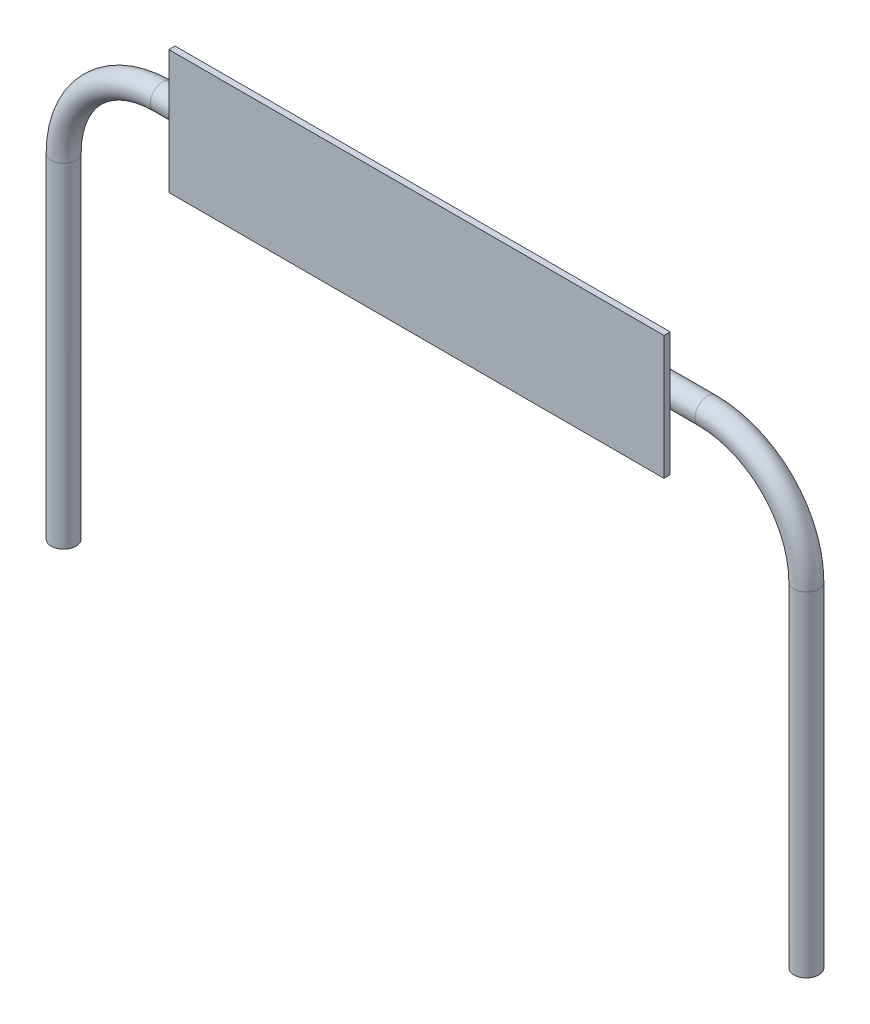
ISO-10303-21;
HEADER;
FILE_DESCRIPTION(('STEP AP214'),'2;1');
FILE_NAME('part.step','',(''),(''),'','','');
FILE_SCHEMA(('AUTOMOTIVE_DESIGN { 1 0 10303 214 1 1 1 1 }'));
ENDSEC;
DATA;
#1=APPLICATION_CONTEXT('core data for automotive mechanical design processes');
#2=APPLICATION_PROTOCOL_DEFINITION('international standard','automotive_design',2000,#1);
#3=PRODUCT_CONTEXT('',#1,'mechanical');
#4=PRODUCT('Part','Part','',(#3));
#5=PRODUCT_RELATED_PRODUCT_CATEGORY('part','',(#4));
#6=PRODUCT_DEFINITION_FORMATION('','',#4);
#7=PRODUCT_DEFINITION_CONTEXT('part definition',#1,'design');
#8=PRODUCT_DEFINITION('design','',#6,#7);
#9=PRODUCT_DEFINITION_SHAPE('','',#8);
#10=(LENGTH_UNIT() NAMED_UNIT(*) SI_UNIT(.MILLI.,.METRE.));
#11=(NAMED_UNIT(*) PLANE_ANGLE_UNIT() SI_UNIT($,.RADIAN.));
#12=(NAMED_UNIT(*) SI_UNIT($,.STERADIAN.) SOLID_ANGLE_UNIT());
#13=UNCERTAINTY_MEASURE_WITH_UNIT(LENGTH_MEASURE(1.E-05),#10,'distance_accuracy_value','');
#14=(GEOMETRIC_REPRESENTATION_CONTEXT(3) GLOBAL_UNCERTAINTY_ASSIGNED_CONTEXT((#13)) GLOBAL_UNIT_ASSIGNED_CONTEXT((#10,
#11,#12)) REPRESENTATION_CONTEXT('',''));
#15=CARTESIAN_POINT('',(0.,0.,0.));
#16=DIRECTION('',(0.,0.,1.));
#17=DIRECTION('',(1.,0.,0.));
#18=AXIS2_PLACEMENT_3D('',#15,#16,#17);
#19=CARTESIAN_POINT('',(-2895.6,-426.720000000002,182.880000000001));
#20=DIRECTION('',(1.,0.,0.));
#21=DIRECTION('',(0.,0.,1.));
#22=AXIS2_PLACEMENT_3D('',#19,#20,#21);
#23=CYLINDRICAL_SURFACE('',#22,121.92);
#24=CARTESIAN_POINT('',(-2438.4,-426.720000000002,182.880000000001));
#25=DIRECTION('',(1.,0.,0.));
#26=DIRECTION('',(0.,0.,-1.));
#27=AXIS2_PLACEMENT_3D('',#24,#25,#26);
#28=CIRCLE('',#27,121.92);
#29=CARTESIAN_POINT('',(-2438.4,-304.800000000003,182.880000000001));
#30=VERTEX_POINT('',#29);
#31=CARTESIAN_POINT('',(-2438.4,-426.720000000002,304.800000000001));
#32=VERTEX_POINT('',#31);
#33=EDGE_CURVE('E195',#30,#32,#28,.T.);
#34=ORIENTED_EDGE('',*,*,#33,.F.);
#35=DIRECTION('',(1.,0.,0.));
#36=VECTOR('',#35,1.);
#37=CARTESIAN_POINT('',(-2895.6,-304.800000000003,182.880000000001));
#38=LINE('',#37,#36);
#39=CARTESIAN_POINT('',(-2895.6,-304.800000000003,182.880000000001));
#40=VERTEX_POINT('',#39);
#41=EDGE_CURVE('E194',#40,#30,#38,.T.);
#42=ORIENTED_EDGE('',*,*,#41,.F.);
#43=CARTESIAN_POINT('',(-2895.6,-426.720000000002,182.880000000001));
#44=DIRECTION('',(1.,0.,0.));
#45=DIRECTION('',(0.,0.,-1.));
#46=AXIS2_PLACEMENT_3D('',#43,#44,#45);
#47=CIRCLE('',#46,121.92);
#48=CARTESIAN_POINT('',(-2895.6,-426.720000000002,304.800000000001));
#49=VERTEX_POINT('',#48);
#50=EDGE_CURVE('E237',#40,#49,#47,.T.);
#51=ORIENTED_EDGE('',*,*,#50,.T.);
#52=DIRECTION('',(1.,0.,0.));
#53=VECTOR('',#52,1.);
#54=CARTESIAN_POINT('',(-2895.6,-426.720000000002,304.800000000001));
#55=LINE('',#54,#53);
#56=EDGE_CURVE('E12',#49,#32,#55,.T.);
#57=ORIENTED_EDGE('',*,*,#56,.T.);
#58=EDGE_LOOP('',(#34,#42,#51,#57));
#59=FACE_BOUND('',#58,.T.);
#60=ADVANCED_FACE('F51',(#59),#23,.T.);
#61=CARTESIAN_POINT('',(-2895.6,-426.720000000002,304.800000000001));
#62=DIRECTION('',(0.,0.,-1.));
#63=DIRECTION('',(1.,0.,0.));
#64=AXIS2_PLACEMENT_3D('',#61,#62,#63);
#65=PLANE('',#64);
#66=DIRECTION('',(0.,-1.,0.));
#67=VECTOR('',#66,1.);
#68=CARTESIAN_POINT('',(-2438.4,-426.720000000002,304.800000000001));
#69=LINE('',#68,#67);
#70=CARTESIAN_POINT('',(-2438.4,-609.600000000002,304.800000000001));
#71=VERTEX_POINT('',#70);
#72=EDGE_CURVE('E197',#32,#71,#69,.T.);
#73=ORIENTED_EDGE('',*,*,#72,.F.);
#74=ORIENTED_EDGE('',*,*,#56,.F.);
#75=DIRECTION('',(0.,-1.,0.));
#76=VECTOR('',#75,1.);
#77=CARTESIAN_POINT('',(-2895.6,-426.720000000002,304.800000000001));
#78=LINE('',#77,#76);
#79=CARTESIAN_POINT('',(-2895.6,-609.600000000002,304.800000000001));
#80=VERTEX_POINT('',#79);
#81=EDGE_CURVE('E129',#49,#80,#78,.T.);
#82=ORIENTED_EDGE('',*,*,#81,.T.);
#83=DIRECTION('',(1.,0.,0.));
#84=VECTOR('',#83,1.);
#85=CARTESIAN_POINT('',(-2895.6,-609.600000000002,304.800000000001));
#86=LINE('',#85,#84);
#87=EDGE_CURVE('E59',#80,#71,#86,.T.);
#88=ORIENTED_EDGE('',*,*,#87,.T.);
#89=EDGE_LOOP('',(#73,#74,#82,#88));
#90=FACE_BOUND('',#89,.T.);
#91=ADVANCED_FACE('F273',(#90),#65,.F.);
#92=CARTESIAN_POINT('',(-2895.6,-609.600000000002,213.360000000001));
#93=DIRECTION('',(0.,1.,0.));
#94=DIRECTION('',(0.,0.,1.));
#95=AXIS2_PLACEMENT_3D('',#92,#93,#94);
#96=PLANE('',#95);
#97=DIRECTION('',(0.,0.,-1.));
#98=VECTOR('',#97,1.);
#99=CARTESIAN_POINT('',(-2438.4,-609.600000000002,213.360000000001));
#100=LINE('',#99,#98);
#101=CARTESIAN_POINT('',(-2438.4,-609.600000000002,213.360000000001));
#102=VERTEX_POINT('',#101);
#103=EDGE_CURVE('E200',#71,#102,#100,.T.);
#104=ORIENTED_EDGE('',*,*,#103,.F.);
#105=ORIENTED_EDGE('',*,*,#87,.F.);
#106=DIRECTION('',(0.,0.,-1.));
#107=VECTOR('',#106,1.);
#108=CARTESIAN_POINT('',(-2895.6,-609.600000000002,213.360000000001));
#109=LINE('',#108,#107);
#110=CARTESIAN_POINT('',(-2895.6,-609.600000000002,213.360000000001));
#111=VERTEX_POINT('',#110);
#112=EDGE_CURVE('E282',#80,#111,#109,.T.);
#113=ORIENTED_EDGE('',*,*,#112,.T.);
#114=DIRECTION('',(1.,0.,0.));
#115=VECTOR('',#114,1.);
#116=CARTESIAN_POINT('',(-2895.6,-609.600000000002,213.360000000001));
#117=LINE('',#116,#115);
#118=EDGE_CURVE('E268',#111,#102,#117,.T.);
#119=ORIENTED_EDGE('',*,*,#118,.T.);
#120=EDGE_LOOP('',(#104,#105,#113,#119));
#121=FACE_BOUND('',#120,.T.);
#122=ADVANCED_FACE('F340',(#121),#96,.F.);
#123=CARTESIAN_POINT('',(-2895.6,-426.720000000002,213.360000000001));
#124=DIRECTION('',(0.,0.,1.));
#125=DIRECTION('',(-1.,0.,0.));
#126=AXIS2_PLACEMENT_3D('',#123,#124,#125);
#127=PLANE('',#126);
#128=DIRECTION('',(0.,1.,0.));
#129=VECTOR('',#128,1.);
#130=CARTESIAN_POINT('',(-2438.4,-426.720000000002,213.360000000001));
#131=LINE('',#130,#129);
#132=CARTESIAN_POINT('',(-2438.4,-426.720000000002,213.360000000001));
#133=VERTEX_POINT('',#132);
#134=EDGE_CURVE('E203',#102,#133,#131,.T.);
#135=ORIENTED_EDGE('',*,*,#134,.F.);
#136=ORIENTED_EDGE('',*,*,#118,.F.);
#137=DIRECTION('',(0.,1.,0.));
#138=VECTOR('',#137,1.);
#139=CARTESIAN_POINT('',(-2895.6,-426.720000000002,213.360000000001));
#140=LINE('',#139,#138);
#141=CARTESIAN_POINT('',(-2895.6,-426.720000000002,213.360000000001));
#142=VERTEX_POINT('',#141);
#143=EDGE_CURVE('E286',#111,#142,#140,.T.);
#144=ORIENTED_EDGE('',*,*,#143,.T.);
#145=DIRECTION('',(1.,0.,0.));
#146=VECTOR('',#145,1.);
#147=CARTESIAN_POINT('',(-2895.6,-426.720000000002,213.360000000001));
#148=LINE('',#147,#146);
#149=EDGE_CURVE('E265',#142,#133,#148,.T.);
#150=ORIENTED_EDGE('',*,*,#149,.T.);
#151=EDGE_LOOP('',(#135,#136,#144,#150));
#152=FACE_BOUND('',#151,.T.);
#153=ADVANCED_FACE('F339',(#152),#127,.F.);
#154=CARTESIAN_POINT('',(-2895.6,-426.720000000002,182.880000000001));
#155=DIRECTION('',(1.,0.,0.));
#156=DIRECTION('',(0.,0.,1.));
#157=AXIS2_PLACEMENT_3D('',#154,#155,#156);
#158=CYLINDRICAL_SURFACE('',#157,30.48);
#159=CARTESIAN_POINT('',(-2438.4,-426.720000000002,182.880000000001));
#160=DIRECTION('',(-1.,0.,0.));
#161=DIRECTION('',(0.,0.,-1.));
#162=AXIS2_PLACEMENT_3D('',#159,#160,#161);
#163=CIRCLE('',#162,30.48);
#164=CARTESIAN_POINT('',(-2438.4,-396.240000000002,182.880000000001));
#165=VERTEX_POINT('',#164);
#166=EDGE_CURVE('E206',#133,#165,#163,.T.);
#167=ORIENTED_EDGE('',*,*,#166,.F.);
#168=ORIENTED_EDGE('',*,*,#149,.F.);
#169=CARTESIAN_POINT('',(-2895.6,-426.720000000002,182.880000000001));
#170=DIRECTION('',(-1.,0.,0.));
#171=DIRECTION('',(0.,0.,-1.));
#172=AXIS2_PLACEMENT_3D('',#169,#170,#171);
#173=CIRCLE('',#172,30.48);
#174=CARTESIAN_POINT('',(-2895.6,-396.240000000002,182.880000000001));
#175=VERTEX_POINT('',#174);
#176=EDGE_CURVE('E289',#142,#175,#173,.T.);
#177=ORIENTED_EDGE('',*,*,#176,.T.);
#178=DIRECTION('',(1.,0.,0.));
#179=VECTOR('',#178,1.);
#180=CARTESIAN_POINT('',(-2895.6,-396.240000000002,182.880000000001));
#181=LINE('',#180,#179);
#182=EDGE_CURVE('E262',#175,#165,#181,.T.);
#183=ORIENTED_EDGE('',*,*,#182,.T.);
#184=EDGE_LOOP('',(#167,#168,#177,#183));
#185=FACE_BOUND('',#184,.T.);
#186=ADVANCED_FACE('F336',(#185),#158,.F.);
#187=CARTESIAN_POINT('',(-2895.6,-396.240000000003,0.));
#188=DIRECTION('',(0.,1.,0.));
#189=DIRECTION('',(0.,0.,1.));
#190=AXIS2_PLACEMENT_3D('',#187,#188,#189);
#191=PLANE('',#190);
#192=DIRECTION('',(0.,0.,-1.));
#193=VECTOR('',#192,1.);
#194=CARTESIAN_POINT('',(-2438.4,-396.240000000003,0.));
#195=LINE('',#194,#193);
#196=CARTESIAN_POINT('',(-2438.4,-396.240000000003,0.));
#197=VERTEX_POINT('',#196);
#198=EDGE_CURVE('E209',#165,#197,#195,.T.);
#199=ORIENTED_EDGE('',*,*,#198,.F.);
#200=ORIENTED_EDGE('',*,*,#182,.F.);
#201=DIRECTION('',(0.,0.,-1.));
#202=VECTOR('',#201,1.);
#203=CARTESIAN_POINT('',(-2895.6,-396.240000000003,0.));
#204=LINE('',#203,#202);
#205=CARTESIAN_POINT('',(-2895.6,-396.240000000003,0.));
#206=VERTEX_POINT('',#205);
#207=EDGE_CURVE('E292',#175,#206,#204,.T.);
#208=ORIENTED_EDGE('',*,*,#207,.T.);
#209=DIRECTION('',(1.,0.,0.));
#210=VECTOR('',#209,1.);
#211=CARTESIAN_POINT('',(-2895.6,-396.240000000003,0.));
#212=LINE('',#211,#210);
#213=EDGE_CURVE('E259',#206,#197,#212,.T.);
#214=ORIENTED_EDGE('',*,*,#213,.T.);
#215=EDGE_LOOP('',(#199,#200,#208,#214));
#216=FACE_BOUND('',#215,.T.);
#217=ADVANCED_FACE('F334',(#216),#191,.F.);
#218=CARTESIAN_POINT('',(-2895.6,-1.77635683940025E-12,0.));
#219=DIRECTION('',(1.,0.,0.));
#220=DIRECTION('',(0.,0.,1.));
#221=AXIS2_PLACEMENT_3D('',#218,#219,#220);
#222=CYLINDRICAL_SURFACE('',#221,396.240000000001);
#223=CARTESIAN_POINT('',(-2438.4,-1.77635683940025E-12,0.));
#224=DIRECTION('',(1.,0.,0.));
#225=DIRECTION('',(0.,0.,-1.));
#226=AXIS2_PLACEMENT_3D('',#223,#224,#225);
#227=CIRCLE('',#226,396.240000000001);
#228=CARTESIAN_POINT('',(-2438.4,396.239999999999,-1.21313511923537E-13));
#229=VERTEX_POINT('',#228);
#230=EDGE_CURVE('E212',#197,#229,#227,.T.);
#231=ORIENTED_EDGE('',*,*,#230,.F.);
#232=ORIENTED_EDGE('',*,*,#213,.F.);
#233=CARTESIAN_POINT('',(-2895.6,-1.77635683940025E-12,0.));
#234=DIRECTION('',(1.,0.,0.));
#235=DIRECTION('',(0.,0.,-1.));
#236=AXIS2_PLACEMENT_3D('',#233,#234,#235);
#237=CIRCLE('',#236,396.240000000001);
#238=CARTESIAN_POINT('',(-2895.6,396.239999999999,-1.21313511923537E-13));
#239=VERTEX_POINT('',#238);
#240=EDGE_CURVE('E295',#206,#239,#237,.T.);
#241=ORIENTED_EDGE('',*,*,#240,.T.);
#242=DIRECTION('',(1.,0.,0.));
#243=VECTOR('',#242,1.);
#244=CARTESIAN_POINT('',(-2895.6,396.239999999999,-1.21313511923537E-13));
#245=LINE('',#244,#243);
#246=EDGE_CURVE('E256',#239,#229,#245,.T.);
#247=ORIENTED_EDGE('',*,*,#246,.T.);
#248=EDGE_LOOP('',(#231,#232,#241,#247));
#249=FACE_BOUND('',#248,.T.);
#250=ADVANCED_FACE('F330',(#249),#222,.T.);
#251=CARTESIAN_POINT('',(-2895.6,396.239999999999,-1.21313511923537E-13));
#252=DIRECTION('',(0.,-1.,0.));
#253=DIRECTION('',(0.,0.,-1.));
#254=AXIS2_PLACEMENT_3D('',#251,#252,#253);
#255=PLANE('',#254);
#256=DIRECTION('',(0.,0.,1.));
#257=VECTOR('',#256,1.);
#258=CARTESIAN_POINT('',(-2438.4,396.239999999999,-1.21313511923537E-13));
#259=LINE('',#258,#257);
#260=CARTESIAN_POINT('',(-2438.4,396.240000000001,182.880000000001));
#261=VERTEX_POINT('',#260);
#262=EDGE_CURVE('E215',#229,#261,#259,.T.);
#263=ORIENTED_EDGE('',*,*,#262,.F.);
#264=ORIENTED_EDGE('',*,*,#246,.F.);
#265=DIRECTION('',(0.,0.,1.));
#266=VECTOR('',#265,1.);
#267=CARTESIAN_POINT('',(-2895.6,396.239999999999,-1.21313511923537E-13));
#268=LINE('',#267,#266);
#269=CARTESIAN_POINT('',(-2895.6,396.240000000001,182.880000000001));
#270=VERTEX_POINT('',#269);
#271=EDGE_CURVE('E298',#239,#270,#268,.T.);
#272=ORIENTED_EDGE('',*,*,#271,.T.);
#273=DIRECTION('',(1.,0.,0.));
#274=VECTOR('',#273,1.);
#275=CARTESIAN_POINT('',(-2895.6,396.240000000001,182.880000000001));
#276=LINE('',#275,#274);
#277=EDGE_CURVE('E253',#270,#261,#276,.T.);
#278=ORIENTED_EDGE('',*,*,#277,.T.);
#279=EDGE_LOOP('',(#263,#264,#272,#278));
#280=FACE_BOUND('',#279,.T.);
#281=ADVANCED_FACE('F327',(#280),#255,.F.);
#282=CARTESIAN_POINT('',(-2895.6,426.720000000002,182.880000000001));
#283=DIRECTION('',(1.,0.,0.));
#284=DIRECTION('',(0.,0.,1.));
#285=AXIS2_PLACEMENT_3D('',#282,#283,#284);
#286=CYLINDRICAL_SURFACE('',#285,30.4800000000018);
#287=CARTESIAN_POINT('',(-2438.4,426.720000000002,182.880000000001));
#288=DIRECTION('',(-1.,0.,0.));
#289=DIRECTION('',(0.,0.,1.));
#290=AXIS2_PLACEMENT_3D('',#287,#288,#289);
#291=CIRCLE('',#290,30.4800000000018);
#292=CARTESIAN_POINT('',(-2438.4,426.720000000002,213.360000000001));
#293=VERTEX_POINT('',#292);
#294=EDGE_CURVE('E218',#261,#293,#291,.T.);
#295=ORIENTED_EDGE('',*,*,#294,.F.);
#296=ORIENTED_EDGE('',*,*,#277,.F.);
#297=CARTESIAN_POINT('',(-2895.6,426.720000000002,182.880000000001));
#298=DIRECTION('',(-1.,0.,0.));
#299=DIRECTION('',(0.,0.,1.));
#300=AXIS2_PLACEMENT_3D('',#297,#298,#299);
#301=CIRCLE('',#300,30.4800000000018);
#302=CARTESIAN_POINT('',(-2895.6,426.720000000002,213.360000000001));
#303=VERTEX_POINT('',#302);
#304=EDGE_CURVE('E301',#270,#303,#301,.T.);
#305=ORIENTED_EDGE('',*,*,#304,.T.);
#306=DIRECTION('',(1.,0.,0.));
#307=VECTOR('',#306,1.);
#308=CARTESIAN_POINT('',(-2895.6,426.720000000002,213.360000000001));
#309=LINE('',#308,#307);
#310=EDGE_CURVE('E250',#303,#293,#309,.T.);
#311=ORIENTED_EDGE('',*,*,#310,.T.);
#312=EDGE_LOOP('',(#295,#296,#305,#311));
#313=FACE_BOUND('',#312,.T.);
#314=ADVANCED_FACE('F325',(#313),#286,.F.);
#315=CARTESIAN_POINT('',(-2895.6,426.720000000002,213.360000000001));
#316=DIRECTION('',(0.,0.,1.));
#317=DIRECTION('',(-1.,0.,0.));
#318=AXIS2_PLACEMENT_3D('',#315,#316,#317);
#319=PLANE('',#318);
#320=DIRECTION('',(0.,1.,0.));
#321=VECTOR('',#320,1.);
#322=CARTESIAN_POINT('',(-2438.4,426.720000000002,213.360000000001));
#323=LINE('',#322,#321);
#324=CARTESIAN_POINT('',(-2438.4,609.600000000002,213.360000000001));
#325=VERTEX_POINT('',#324);
#326=EDGE_CURVE('E221',#293,#325,#323,.T.);
#327=ORIENTED_EDGE('',*,*,#326,.F.);
#328=ORIENTED_EDGE('',*,*,#310,.F.);
#329=DIRECTION('',(0.,1.,0.));
#330=VECTOR('',#329,1.);
#331=CARTESIAN_POINT('',(-2895.6,426.720000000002,213.360000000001));
#332=LINE('',#331,#330);
#333=CARTESIAN_POINT('',(-2895.6,609.600000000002,213.360000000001));
#334=VERTEX_POINT('',#333);
#335=EDGE_CURVE('E304',#303,#334,#332,.T.);
#336=ORIENTED_EDGE('',*,*,#335,.T.);
#337=DIRECTION('',(1.,0.,0.));
#338=VECTOR('',#337,1.);
#339=CARTESIAN_POINT('',(-2895.6,609.600000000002,213.360000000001));
#340=LINE('',#339,#338);
#341=EDGE_CURVE('E247',#334,#325,#340,.T.);
#342=ORIENTED_EDGE('',*,*,#341,.T.);
#343=EDGE_LOOP('',(#327,#328,#336,#342));
#344=FACE_BOUND('',#343,.T.);
#345=ADVANCED_FACE('F321',(#344),#319,.F.);
#346=CARTESIAN_POINT('',(-2895.6,609.600000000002,213.360000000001));
#347=DIRECTION('',(0.,-1.,0.));
#348=DIRECTION('',(0.,0.,-1.));
#349=AXIS2_PLACEMENT_3D('',#346,#347,#348);
#350=PLANE('',#349);
#351=DIRECTION('',(0.,0.,1.));
#352=VECTOR('',#351,1.);
#353=CARTESIAN_POINT('',(-2438.4,609.600000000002,213.360000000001));
#354=LINE('',#353,#352);
#355=CARTESIAN_POINT('',(-2438.4,609.600000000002,304.800000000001));
#356=VERTEX_POINT('',#355);
#357=EDGE_CURVE('E224',#325,#356,#354,.T.);
#358=ORIENTED_EDGE('',*,*,#357,.F.);
#359=ORIENTED_EDGE('',*,*,#341,.F.);
#360=DIRECTION('',(0.,0.,1.));
#361=VECTOR('',#360,1.);
#362=CARTESIAN_POINT('',(-2895.6,609.600000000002,213.360000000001));
#363=LINE('',#362,#361);
#364=CARTESIAN_POINT('',(-2895.6,609.600000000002,304.800000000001));
#365=VERTEX_POINT('',#364);
#366=EDGE_CURVE('E307',#334,#365,#363,.T.);
#367=ORIENTED_EDGE('',*,*,#366,.T.);
#368=DIRECTION('',(1.,0.,0.));
#369=VECTOR('',#368,1.);
#370=CARTESIAN_POINT('',(-2895.6,609.600000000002,304.800000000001));
#371=LINE('',#370,#369);
#372=EDGE_CURVE('E244',#365,#356,#371,.T.);
#373=ORIENTED_EDGE('',*,*,#372,.T.);
#374=EDGE_LOOP('',(#358,#359,#367,#373));
#375=FACE_BOUND('',#374,.T.);
#376=ADVANCED_FACE('F318',(#375),#350,.F.);
#377=CARTESIAN_POINT('',(-2895.6,426.720000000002,304.800000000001));
#378=DIRECTION('',(0.,0.,-1.));
#379=DIRECTION('',(1.,0.,0.));
#380=AXIS2_PLACEMENT_3D('',#377,#378,#379);
#381=PLANE('',#380);
#382=DIRECTION('',(0.,-1.,0.));
#383=VECTOR('',#382,1.);
#384=CARTESIAN_POINT('',(-2438.4,426.720000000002,304.800000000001));
#385=LINE('',#384,#383);
#386=CARTESIAN_POINT('',(-2438.4,426.720000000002,304.800000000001));
#387=VERTEX_POINT('',#386);
#388=EDGE_CURVE('E227',#356,#387,#385,.T.);
#389=ORIENTED_EDGE('',*,*,#388,.F.);
#390=ORIENTED_EDGE('',*,*,#372,.F.);
#391=DIRECTION('',(0.,-1.,0.));
#392=VECTOR('',#391,1.);
#393=CARTESIAN_POINT('',(-2895.6,426.720000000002,304.800000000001));
#394=LINE('',#393,#392);
#395=CARTESIAN_POINT('',(-2895.6,426.720000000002,304.800000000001));
#396=VERTEX_POINT('',#395);
#397=EDGE_CURVE('E189',#365,#396,#394,.T.);
#398=ORIENTED_EDGE('',*,*,#397,.T.);
#399=DIRECTION('',(1.,0.,0.));
#400=VECTOR('',#399,1.);
#401=CARTESIAN_POINT('',(-2895.6,426.720000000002,304.800000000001));
#402=LINE('',#401,#400);
#403=EDGE_CURVE('E241',#396,#387,#402,.T.);
#404=ORIENTED_EDGE('',*,*,#403,.T.);
#405=EDGE_LOOP('',(#389,#390,#398,#404));
#406=FACE_BOUND('',#405,.T.);
#407=ADVANCED_FACE('F312',(#406),#381,.F.);
#408=CARTESIAN_POINT('',(-2895.6,426.720000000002,182.880000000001));
#409=DIRECTION('',(1.,0.,0.));
#410=DIRECTION('',(0.,0.,1.));
#411=AXIS2_PLACEMENT_3D('',#408,#409,#410);
#412=CYLINDRICAL_SURFACE('',#411,121.92);
#413=CARTESIAN_POINT('',(-2438.4,426.720000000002,182.880000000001));
#414=DIRECTION('',(1.,0.,0.));
#415=DIRECTION('',(0.,0.,1.));
#416=AXIS2_PLACEMENT_3D('',#413,#414,#415);
#417=CIRCLE('',#416,121.92);
#418=CARTESIAN_POINT('',(-2438.4,304.800000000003,182.880000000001));
#419=VERTEX_POINT('',#418);
#420=EDGE_CURVE('E230',#387,#419,#417,.T.);
#421=ORIENTED_EDGE('',*,*,#420,.F.);
#422=ORIENTED_EDGE('',*,*,#403,.F.);
#423=CARTESIAN_POINT('',(-2895.6,426.720000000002,182.880000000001));
#424=DIRECTION('',(1.,0.,0.));
#425=DIRECTION('',(0.,0.,1.));
#426=AXIS2_PLACEMENT_3D('',#423,#424,#425);
#427=CIRCLE('',#426,121.92);
#428=CARTESIAN_POINT('',(-2895.6,304.800000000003,182.880000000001));
#429=VERTEX_POINT('',#428);
#430=EDGE_CURVE('E187',#396,#429,#427,.T.);
#431=ORIENTED_EDGE('',*,*,#430,.T.);
#432=DIRECTION('',(1.,0.,0.));
#433=VECTOR('',#432,1.);
#434=CARTESIAN_POINT('',(-2895.6,304.800000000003,182.880000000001));
#435=LINE('',#434,#433);
#436=EDGE_CURVE('E181',#429,#419,#435,.T.);
#437=ORIENTED_EDGE('',*,*,#436,.T.);
#438=EDGE_LOOP('',(#421,#422,#431,#437));
#439=FACE_BOUND('',#438,.T.);
#440=ADVANCED_FACE('F316',(#439),#412,.T.);
#441=CARTESIAN_POINT('',(-2895.6,304.799999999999,0.));
#442=DIRECTION('',(0.,1.,0.));
#443=DIRECTION('',(0.,0.,1.));
#444=AXIS2_PLACEMENT_3D('',#441,#442,#443);
#445=PLANE('',#444);
#446=DIRECTION('',(0.,0.,-1.));
#447=VECTOR('',#446,1.);
#448=CARTESIAN_POINT('',(-2438.4,304.799999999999,0.));
#449=LINE('',#448,#447);
#450=CARTESIAN_POINT('',(-2438.4,304.799999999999,0.));
#451=VERTEX_POINT('',#450);
#452=EDGE_CURVE('E233',#419,#451,#449,.T.);
#453=ORIENTED_EDGE('',*,*,#452,.F.);
#454=ORIENTED_EDGE('',*,*,#436,.F.);
#455=DIRECTION('',(0.,0.,-1.));
#456=VECTOR('',#455,1.);
#457=CARTESIAN_POINT('',(-2895.6,304.799999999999,0.));
#458=LINE('',#457,#456);
#459=CARTESIAN_POINT('',(-2895.6,304.799999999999,0.));
#460=VERTEX_POINT('',#459);
#461=EDGE_CURVE('E171',#429,#460,#458,.T.);
#462=ORIENTED_EDGE('',*,*,#461,.T.);
#463=DIRECTION('',(1.,0.,0.));
#464=VECTOR('',#463,1.);
#465=CARTESIAN_POINT('',(-2895.6,304.799999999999,0.));
#466=LINE('',#465,#464);
#467=EDGE_CURVE('E176',#460,#451,#466,.T.);
#468=ORIENTED_EDGE('',*,*,#467,.T.);
#469=EDGE_LOOP('',(#453,#454,#462,#468));
#470=FACE_BOUND('',#469,.T.);
#471=ADVANCED_FACE('F184',(#470),#445,.F.);
#472=CARTESIAN_POINT('',(-2895.6,-1.77635683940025E-12,0.));
#473=DIRECTION('',(1.,0.,0.));
#474=DIRECTION('',(0.,0.,1.));
#475=AXIS2_PLACEMENT_3D('',#472,#473,#474);
#476=CYLINDRICAL_SURFACE('',#475,304.800000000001);
#477=CARTESIAN_POINT('',(-2438.4,-1.77635683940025E-12,0.));
#478=DIRECTION('',(-1.,0.,0.));
#479=DIRECTION('',(0.,0.,-1.));
#480=AXIS2_PLACEMENT_3D('',#477,#478,#479);
#481=CIRCLE('',#480,304.800000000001);
#482=CARTESIAN_POINT('',(-2438.4,-304.800000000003,0.));
#483=VERTEX_POINT('',#482);
#484=EDGE_CURVE('E178',#451,#483,#481,.T.);
#485=ORIENTED_EDGE('',*,*,#484,.F.);
#486=ORIENTED_EDGE('',*,*,#467,.F.);
#487=CARTESIAN_POINT('',(-2895.6,-1.77635683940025E-12,0.));
#488=DIRECTION('',(-1.,0.,0.));
#489=DIRECTION('',(0.,0.,-1.));
#490=AXIS2_PLACEMENT_3D('',#487,#488,#489);
#491=CIRCLE('',#490,304.800000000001);
#492=CARTESIAN_POINT('',(-2895.6,-304.800000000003,0.));
#493=VERTEX_POINT('',#492);
#494=EDGE_CURVE('E167',#460,#493,#491,.T.);
#495=ORIENTED_EDGE('',*,*,#494,.T.);
#496=DIRECTION('',(1.,0.,0.));
#497=VECTOR('',#496,1.);
#498=CARTESIAN_POINT('',(-2895.6,-304.800000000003,0.));
#499=LINE('',#498,#497);
#500=EDGE_CURVE('E182',#493,#483,#499,.T.);
#501=ORIENTED_EDGE('',*,*,#500,.T.);
#502=EDGE_LOOP('',(#485,#486,#495,#501));
#503=FACE_BOUND('',#502,.T.);
#504=ADVANCED_FACE('F177',(#503),#476,.F.);
#505=CARTESIAN_POINT('',(-2895.6,-304.800000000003,0.));
#506=DIRECTION('',(0.,-1.,0.));
#507=DIRECTION('',(0.,0.,-1.));
#508=AXIS2_PLACEMENT_3D('',#505,#506,#507);
#509=PLANE('',#508);
#510=DIRECTION('',(0.,0.,1.));
#511=VECTOR('',#510,1.);
#512=CARTESIAN_POINT('',(-2438.4,-304.800000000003,0.));
#513=LINE('',#512,#511);
#514=EDGE_CURVE('E117',#483,#30,#513,.T.);
#515=ORIENTED_EDGE('',*,*,#514,.F.);
#516=ORIENTED_EDGE('',*,*,#500,.F.);
#517=DIRECTION('',(0.,0.,1.));
#518=VECTOR('',#517,1.);
#519=CARTESIAN_POINT('',(-2895.6,-304.800000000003,0.));
#520=LINE('',#519,#518);
#521=EDGE_CURVE('E67',#493,#40,#520,.T.);
#522=ORIENTED_EDGE('',*,*,#521,.T.);
#523=ORIENTED_EDGE('',*,*,#41,.T.);
#524=EDGE_LOOP('',(#515,#516,#522,#523));
#525=FACE_BOUND('',#524,.T.);
#526=ADVANCED_FACE('F470',(#525),#509,.F.);
#527=CARTESIAN_POINT('',(-2895.6,-426.720000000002,182.880000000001));
#528=DIRECTION('',(-1.,0.,0.));
#529=DIRECTION('',(0.,0.,-1.));
#530=AXIS2_PLACEMENT_3D('',#527,#528,#529);
#531=PLANE('',#530);
#532=ORIENTED_EDGE('',*,*,#50,.F.);
#533=ORIENTED_EDGE('',*,*,#521,.F.);
#534=ORIENTED_EDGE('',*,*,#494,.F.);
#535=ORIENTED_EDGE('',*,*,#461,.F.);
#536=ORIENTED_EDGE('',*,*,#430,.F.);
#537=ORIENTED_EDGE('',*,*,#397,.F.);
#538=ORIENTED_EDGE('',*,*,#366,.F.);
#539=ORIENTED_EDGE('',*,*,#335,.F.);
#540=ORIENTED_EDGE('',*,*,#304,.F.);
#541=ORIENTED_EDGE('',*,*,#271,.F.);
#542=ORIENTED_EDGE('',*,*,#240,.F.);
#543=ORIENTED_EDGE('',*,*,#207,.F.);
#544=ORIENTED_EDGE('',*,*,#176,.F.);
#545=ORIENTED_EDGE('',*,*,#143,.F.);
#546=ORIENTED_EDGE('',*,*,#112,.F.);
#547=ORIENTED_EDGE('',*,*,#81,.F.);
#548=EDGE_LOOP('',(#532,#533,#534,#535,#536,#537,#538,#539,#540,#541,#542,#543,#544,#545,#546,#547));
#549=FACE_BOUND('',#548,.T.);
#550=ADVANCED_FACE('F169',(#549),#531,.T.);
#551=CARTESIAN_POINT('',(-2438.4,-426.720000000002,182.880000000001));
#552=DIRECTION('',(-1.,0.,0.));
#553=DIRECTION('',(0.,0.,-1.));
#554=AXIS2_PLACEMENT_3D('',#551,#552,#553);
#555=PLANE('',#554);
#556=ORIENTED_EDGE('',*,*,#33,.T.);
#557=ORIENTED_EDGE('',*,*,#72,.T.);
#558=ORIENTED_EDGE('',*,*,#103,.T.);
#559=ORIENTED_EDGE('',*,*,#134,.T.);
#560=ORIENTED_EDGE('',*,*,#166,.T.);
#561=ORIENTED_EDGE('',*,*,#198,.T.);
#562=ORIENTED_EDGE('',*,*,#230,.T.);
#563=ORIENTED_EDGE('',*,*,#262,.T.);
#564=ORIENTED_EDGE('',*,*,#294,.T.);
#565=ORIENTED_EDGE('',*,*,#326,.T.);
#566=ORIENTED_EDGE('',*,*,#357,.T.);
#567=ORIENTED_EDGE('',*,*,#388,.T.);
#568=ORIENTED_EDGE('',*,*,#420,.T.);
#569=ORIENTED_EDGE('',*,*,#452,.T.);
#570=ORIENTED_EDGE('',*,*,#484,.T.);
#571=ORIENTED_EDGE('',*,*,#514,.T.);
#572=EDGE_LOOP('',(#556,#557,#558,#559,#560,#561,#562,#563,#564,#565,#566,#567,#568,#569,#570,#571));
#573=FACE_BOUND('',#572,.T.);
#574=ADVANCED_FACE('F276',(#573),#555,.F.);
#575=CLOSED_SHELL('',(#60,#91,#122,#153,#186,#217,#250,#281,#314,#345,#376,#407,#440,#471,#504,
#526,#550,#574));
#576=MANIFOLD_SOLID_BREP('B2',#575);
#577=CARTESIAN_POINT('',(2895.6,-426.720000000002,182.880000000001));
#578=DIRECTION('',(-1.,0.,0.));
#579=DIRECTION('',(0.,0.,1.));
#580=AXIS2_PLACEMENT_3D('',#577,#578,#579);
#581=CYLINDRICAL_SURFACE('',#580,121.92);
#582=CARTESIAN_POINT('',(2438.4,-426.720000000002,182.880000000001));
#583=DIRECTION('',(1.,0.,0.));
#584=DIRECTION('',(0.,0.,-1.));
#585=AXIS2_PLACEMENT_3D('',#582,#583,#584);
#586=CIRCLE('',#585,121.92);
#587=CARTESIAN_POINT('',(2438.4,-304.800000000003,182.880000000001));
#588=VERTEX_POINT('',#587);
#589=CARTESIAN_POINT('',(2438.4,-426.720000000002,304.800000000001));
#590=VERTEX_POINT('',#589);
#591=EDGE_CURVE('E670',#588,#590,#586,.T.);
#592=ORIENTED_EDGE('',*,*,#591,.T.);
#593=DIRECTION('',(-1.,0.,0.));
#594=VECTOR('',#593,1.);
#595=CARTESIAN_POINT('',(2895.6,-426.720000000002,304.800000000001));
#596=LINE('',#595,#594);
#597=CARTESIAN_POINT('',(2895.6,-426.720000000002,304.800000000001));
#598=VERTEX_POINT('',#597);
#599=EDGE_CURVE('E49',#598,#590,#596,.T.);
#600=ORIENTED_EDGE('',*,*,#599,.F.);
#601=CARTESIAN_POINT('',(2895.6,-426.720000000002,182.880000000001));
#602=DIRECTION('',(1.,0.,0.));
#603=DIRECTION('',(0.,0.,-1.));
#604=AXIS2_PLACEMENT_3D('',#601,#602,#603);
#605=CIRCLE('',#604,121.92);
#606=CARTESIAN_POINT('',(2895.6,-304.800000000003,182.880000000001));
#607=VERTEX_POINT('',#606);
#608=EDGE_CURVE('E700',#607,#598,#605,.T.);
#609=ORIENTED_EDGE('',*,*,#608,.F.);
#610=DIRECTION('',(-1.,0.,0.));
#611=VECTOR('',#610,1.);
#612=CARTESIAN_POINT('',(2895.6,-304.800000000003,182.880000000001));
#613=LINE('',#612,#611);
#614=EDGE_CURVE('E666',#607,#588,#613,.T.);
#615=ORIENTED_EDGE('',*,*,#614,.T.);
#616=EDGE_LOOP('',(#592,#600,#609,#615));
#617=FACE_BOUND('',#616,.T.);
#618=ADVANCED_FACE('F526',(#617),#581,.T.);
#619=CARTESIAN_POINT('',(2895.6,-426.720000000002,304.800000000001));
#620=DIRECTION('',(0.,0.,-1.));
#621=DIRECTION('',(-1.,0.,0.));
#622=AXIS2_PLACEMENT_3D('',#619,#620,#621);
#623=PLANE('',#622);
#624=DIRECTION('',(0.,-1.,0.));
#625=VECTOR('',#624,1.);
#626=CARTESIAN_POINT('',(2438.4,-426.720000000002,304.800000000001));
#627=LINE('',#626,#625);
#628=CARTESIAN_POINT('',(2438.4,-609.600000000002,304.800000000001));
#629=VERTEX_POINT('',#628);
#630=EDGE_CURVE('E673',#590,#629,#627,.T.);
#631=ORIENTED_EDGE('',*,*,#630,.T.);
#632=DIRECTION('',(-1.,0.,0.));
#633=VECTOR('',#632,1.);
#634=CARTESIAN_POINT('',(2895.6,-609.600000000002,304.800000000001));
#635=LINE('',#634,#633);
#636=CARTESIAN_POINT('',(2895.6,-609.600000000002,304.800000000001));
#637=VERTEX_POINT('',#636);
#638=EDGE_CURVE('E534',#637,#629,#635,.T.);
#639=ORIENTED_EDGE('',*,*,#638,.F.);
#640=DIRECTION('',(0.,-1.,0.));
#641=VECTOR('',#640,1.);
#642=CARTESIAN_POINT('',(2895.6,-426.720000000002,304.800000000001));
#643=LINE('',#642,#641);
#644=EDGE_CURVE('E609',#598,#637,#643,.T.);
#645=ORIENTED_EDGE('',*,*,#644,.F.);
#646=ORIENTED_EDGE('',*,*,#599,.T.);
#647=EDGE_LOOP('',(#631,#639,#645,#646));
#648=FACE_BOUND('',#647,.T.);
#649=ADVANCED_FACE('F798',(#648),#623,.F.);
#650=CARTESIAN_POINT('',(2895.6,-609.600000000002,213.360000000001));
#651=DIRECTION('',(0.,1.,0.));
#652=DIRECTION('',(0.,0.,1.));
#653=AXIS2_PLACEMENT_3D('',#650,#651,#652);
#654=PLANE('',#653);
#655=DIRECTION('',(0.,0.,-1.));
#656=VECTOR('',#655,1.);
#657=CARTESIAN_POINT('',(2438.4,-609.600000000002,213.360000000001));
#658=LINE('',#657,#656);
#659=CARTESIAN_POINT('',(2438.4,-609.600000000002,213.360000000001));
#660=VERTEX_POINT('',#659);
#661=EDGE_CURVE('E675',#629,#660,#658,.T.);
#662=ORIENTED_EDGE('',*,*,#661,.T.);
#663=DIRECTION('',(-1.,0.,0.));
#664=VECTOR('',#663,1.);
#665=CARTESIAN_POINT('',(2895.6,-609.600000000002,213.360000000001));
#666=LINE('',#665,#664);
#667=CARTESIAN_POINT('',(2895.6,-609.600000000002,213.360000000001));
#668=VERTEX_POINT('',#667);
#669=EDGE_CURVE('E731',#668,#660,#666,.T.);
#670=ORIENTED_EDGE('',*,*,#669,.F.);
#671=DIRECTION('',(0.,0.,-1.));
#672=VECTOR('',#671,1.);
#673=CARTESIAN_POINT('',(2895.6,-609.600000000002,213.360000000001));
#674=LINE('',#673,#672);
#675=EDGE_CURVE('E739',#637,#668,#674,.T.);
#676=ORIENTED_EDGE('',*,*,#675,.F.);
#677=ORIENTED_EDGE('',*,*,#638,.T.);
#678=EDGE_LOOP('',(#662,#670,#676,#677));
#679=FACE_BOUND('',#678,.T.);
#680=ADVANCED_FACE('F737',(#679),#654,.F.);
#681=CARTESIAN_POINT('',(2895.6,-426.720000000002,213.360000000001));
#682=DIRECTION('',(0.,0.,1.));
#683=DIRECTION('',(1.,0.,0.));
#684=AXIS2_PLACEMENT_3D('',#681,#682,#683);
#685=PLANE('',#684);
#686=DIRECTION('',(0.,1.,0.));
#687=VECTOR('',#686,1.);
#688=CARTESIAN_POINT('',(2438.4,-426.720000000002,213.360000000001));
#689=LINE('',#688,#687);
#690=CARTESIAN_POINT('',(2438.4,-426.720000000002,213.360000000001));
#691=VERTEX_POINT('',#690);
#692=EDGE_CURVE('E677',#660,#691,#689,.T.);
#693=ORIENTED_EDGE('',*,*,#692,.T.);
#694=DIRECTION('',(-1.,0.,0.));
#695=VECTOR('',#694,1.);
#696=CARTESIAN_POINT('',(2895.6,-426.720000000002,213.360000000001));
#697=LINE('',#696,#695);
#698=CARTESIAN_POINT('',(2895.6,-426.720000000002,213.360000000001));
#699=VERTEX_POINT('',#698);
#700=EDGE_CURVE('E728',#699,#691,#697,.T.);
#701=ORIENTED_EDGE('',*,*,#700,.F.);
#702=DIRECTION('',(0.,1.,0.));
#703=VECTOR('',#702,1.);
#704=CARTESIAN_POINT('',(2895.6,-426.720000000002,213.360000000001));
#705=LINE('',#704,#703);
#706=EDGE_CURVE('E757',#668,#699,#705,.T.);
#707=ORIENTED_EDGE('',*,*,#706,.F.);
#708=ORIENTED_EDGE('',*,*,#669,.T.);
#709=EDGE_LOOP('',(#693,#701,#707,#708));
#710=FACE_BOUND('',#709,.T.);
#711=ADVANCED_FACE('F748',(#710),#685,.F.);
#712=CARTESIAN_POINT('',(2895.6,-426.720000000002,182.880000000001));
#713=DIRECTION('',(-1.,0.,0.));
#714=DIRECTION('',(0.,0.,1.));
#715=AXIS2_PLACEMENT_3D('',#712,#713,#714);
#716=CYLINDRICAL_SURFACE('',#715,30.48);
#717=CARTESIAN_POINT('',(2438.4,-426.720000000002,182.880000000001));
#718=DIRECTION('',(-1.,0.,0.));
#719=DIRECTION('',(0.,0.,-1.));
#720=AXIS2_PLACEMENT_3D('',#717,#718,#719);
#721=CIRCLE('',#720,30.48);
#722=CARTESIAN_POINT('',(2438.4,-396.240000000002,182.880000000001));
#723=VERTEX_POINT('',#722);
#724=EDGE_CURVE('E679',#691,#723,#721,.T.);
#725=ORIENTED_EDGE('',*,*,#724,.T.);
#726=DIRECTION('',(-1.,0.,0.));
#727=VECTOR('',#726,1.);
#728=CARTESIAN_POINT('',(2895.6,-396.240000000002,182.880000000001));
#729=LINE('',#728,#727);
#730=CARTESIAN_POINT('',(2895.6,-396.240000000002,182.880000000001));
#731=VERTEX_POINT('',#730);
#732=EDGE_CURVE('E725',#731,#723,#729,.T.);
#733=ORIENTED_EDGE('',*,*,#732,.F.);
#734=CARTESIAN_POINT('',(2895.6,-426.720000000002,182.880000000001));
#735=DIRECTION('',(-1.,0.,0.));
#736=DIRECTION('',(0.,0.,-1.));
#737=AXIS2_PLACEMENT_3D('',#734,#735,#736);
#738=CIRCLE('',#737,30.48);
#739=EDGE_CURVE('E754',#699,#731,#738,.T.);
#740=ORIENTED_EDGE('',*,*,#739,.F.);
#741=ORIENTED_EDGE('',*,*,#700,.T.);
#742=EDGE_LOOP('',(#725,#733,#740,#741));
#743=FACE_BOUND('',#742,.T.);
#744=ADVANCED_FACE('F752',(#743),#716,.F.);
#745=CARTESIAN_POINT('',(2895.6,-396.240000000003,0.));
#746=DIRECTION('',(0.,1.,0.));
#747=DIRECTION('',(0.,0.,1.));
#748=AXIS2_PLACEMENT_3D('',#745,#746,#747);
#749=PLANE('',#748);
#750=DIRECTION('',(0.,0.,-1.));
#751=VECTOR('',#750,1.);
#752=CARTESIAN_POINT('',(2438.4,-396.240000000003,0.));
#753=LINE('',#752,#751);
#754=CARTESIAN_POINT('',(2438.4,-396.240000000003,0.));
#755=VERTEX_POINT('',#754);
#756=EDGE_CURVE('E681',#723,#755,#753,.T.);
#757=ORIENTED_EDGE('',*,*,#756,.T.);
#758=DIRECTION('',(-1.,0.,0.));
#759=VECTOR('',#758,1.);
#760=CARTESIAN_POINT('',(2895.6,-396.240000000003,0.));
#761=LINE('',#760,#759);
#762=CARTESIAN_POINT('',(2895.6,-396.240000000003,0.));
#763=VERTEX_POINT('',#762);
#764=EDGE_CURVE('E722',#763,#755,#761,.T.);
#765=ORIENTED_EDGE('',*,*,#764,.F.);
#766=DIRECTION('',(0.,0.,-1.));
#767=VECTOR('',#766,1.);
#768=CARTESIAN_POINT('',(2895.6,-396.240000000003,0.));
#769=LINE('',#768,#767);
#770=EDGE_CURVE('E756',#731,#763,#769,.T.);
#771=ORIENTED_EDGE('',*,*,#770,.F.);
#772=ORIENTED_EDGE('',*,*,#732,.T.);
#773=EDGE_LOOP('',(#757,#765,#771,#772));
#774=FACE_BOUND('',#773,.T.);
#775=ADVANCED_FACE('F811',(#774),#749,.F.);
#776=CARTESIAN_POINT('',(2895.6,-1.77635683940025E-12,0.));
#777=DIRECTION('',(-1.,0.,0.));
#778=DIRECTION('',(0.,0.,1.));
#779=AXIS2_PLACEMENT_3D('',#776,#777,#778);
#780=CYLINDRICAL_SURFACE('',#779,396.240000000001);
#781=CARTESIAN_POINT('',(2438.4,-1.77635683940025E-12,0.));
#782=DIRECTION('',(1.,0.,0.));
#783=DIRECTION('',(0.,0.,-1.));
#784=AXIS2_PLACEMENT_3D('',#781,#782,#783);
#785=CIRCLE('',#784,396.240000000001);
#786=CARTESIAN_POINT('',(2438.4,396.239999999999,-1.21313511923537E-13));
#787=VERTEX_POINT('',#786);
#788=EDGE_CURVE('E683',#755,#787,#785,.T.);
#789=ORIENTED_EDGE('',*,*,#788,.T.);
#790=DIRECTION('',(-1.,0.,0.));
#791=VECTOR('',#790,1.);
#792=CARTESIAN_POINT('',(2895.6,396.239999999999,-1.21313511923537E-13));
#793=LINE('',#792,#791);
#794=CARTESIAN_POINT('',(2895.6,396.239999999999,-1.21313511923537E-13));
#795=VERTEX_POINT('',#794);
#796=EDGE_CURVE('E719',#795,#787,#793,.T.);
#797=ORIENTED_EDGE('',*,*,#796,.F.);
#798=CARTESIAN_POINT('',(2895.6,-1.77635683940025E-12,0.));
#799=DIRECTION('',(1.,0.,0.));
#800=DIRECTION('',(0.,0.,-1.));
#801=AXIS2_PLACEMENT_3D('',#798,#799,#800);
#802=CIRCLE('',#801,396.240000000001);
#803=EDGE_CURVE('E759',#763,#795,#802,.T.);
#804=ORIENTED_EDGE('',*,*,#803,.F.);
#805=ORIENTED_EDGE('',*,*,#764,.T.);
#806=EDGE_LOOP('',(#789,#797,#804,#805));
#807=FACE_BOUND('',#806,.T.);
#808=ADVANCED_FACE('F814',(#807),#780,.T.);
#809=CARTESIAN_POINT('',(2895.6,396.239999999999,-1.21313511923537E-13));
#810=DIRECTION('',(0.,-1.,0.));
#811=DIRECTION('',(0.,0.,-1.));
#812=AXIS2_PLACEMENT_3D('',#809,#810,#811);
#813=PLANE('',#812);
#814=DIRECTION('',(0.,0.,1.));
#815=VECTOR('',#814,1.);
#816=CARTESIAN_POINT('',(2438.4,396.239999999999,-1.21313511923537E-13));
#817=LINE('',#816,#815);
#818=CARTESIAN_POINT('',(2438.4,396.240000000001,182.880000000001));
#819=VERTEX_POINT('',#818);
#820=EDGE_CURVE('E685',#787,#819,#817,.T.);
#821=ORIENTED_EDGE('',*,*,#820,.T.);
#822=DIRECTION('',(-1.,0.,0.));
#823=VECTOR('',#822,1.);
#824=CARTESIAN_POINT('',(2895.6,396.240000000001,182.880000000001));
#825=LINE('',#824,#823);
#826=CARTESIAN_POINT('',(2895.6,396.240000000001,182.880000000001));
#827=VERTEX_POINT('',#826);
#828=EDGE_CURVE('E716',#827,#819,#825,.T.);
#829=ORIENTED_EDGE('',*,*,#828,.F.);
#830=DIRECTION('',(0.,0.,1.));
#831=VECTOR('',#830,1.);
#832=CARTESIAN_POINT('',(2895.6,396.239999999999,-1.21313511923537E-13));
#833=LINE('',#832,#831);
#834=EDGE_CURVE('E765',#795,#827,#833,.T.);
#835=ORIENTED_EDGE('',*,*,#834,.F.);
#836=ORIENTED_EDGE('',*,*,#796,.T.);
#837=EDGE_LOOP('',(#821,#829,#835,#836));
#838=FACE_BOUND('',#837,.T.);
#839=ADVANCED_FACE('F818',(#838),#813,.F.);
#840=CARTESIAN_POINT('',(2895.6,426.720000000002,182.880000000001));
#841=DIRECTION('',(-1.,0.,0.));
#842=DIRECTION('',(0.,0.,1.));
#843=AXIS2_PLACEMENT_3D('',#840,#841,#842);
#844=CYLINDRICAL_SURFACE('',#843,30.4800000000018);
#845=CARTESIAN_POINT('',(2438.4,426.720000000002,182.880000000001));
#846=DIRECTION('',(-1.,0.,0.));
#847=DIRECTION('',(0.,0.,1.));
#848=AXIS2_PLACEMENT_3D('',#845,#846,#847);
#849=CIRCLE('',#848,30.4800000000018);
#850=CARTESIAN_POINT('',(2438.4,426.720000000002,213.360000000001));
#851=VERTEX_POINT('',#850);
#852=EDGE_CURVE('E687',#819,#851,#849,.T.);
#853=ORIENTED_EDGE('',*,*,#852,.T.);
#854=DIRECTION('',(-1.,0.,0.));
#855=VECTOR('',#854,1.);
#856=CARTESIAN_POINT('',(2895.6,426.720000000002,213.360000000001));
#857=LINE('',#856,#855);
#858=CARTESIAN_POINT('',(2895.6,426.720000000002,213.360000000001));
#859=VERTEX_POINT('',#858);
#860=EDGE_CURVE('E713',#859,#851,#857,.T.);
#861=ORIENTED_EDGE('',*,*,#860,.F.);
#862=CARTESIAN_POINT('',(2895.6,426.720000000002,182.880000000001));
#863=DIRECTION('',(-1.,0.,0.));
#864=DIRECTION('',(0.,0.,1.));
#865=AXIS2_PLACEMENT_3D('',#862,#863,#864);
#866=CIRCLE('',#865,30.4800000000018);
#867=EDGE_CURVE('E767',#827,#859,#866,.T.);
#868=ORIENTED_EDGE('',*,*,#867,.F.);
#869=ORIENTED_EDGE('',*,*,#828,.T.);
#870=EDGE_LOOP('',(#853,#861,#868,#869));
#871=FACE_BOUND('',#870,.T.);
#872=ADVANCED_FACE('F822',(#871),#844,.F.);
#873=CARTESIAN_POINT('',(2895.6,426.720000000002,213.360000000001));
#874=DIRECTION('',(0.,0.,1.));
#875=DIRECTION('',(1.,0.,0.));
#876=AXIS2_PLACEMENT_3D('',#873,#874,#875);
#877=PLANE('',#876);
#878=DIRECTION('',(0.,1.,0.));
#879=VECTOR('',#878,1.);
#880=CARTESIAN_POINT('',(2438.4,426.720000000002,213.360000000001));
#881=LINE('',#880,#879);
#882=CARTESIAN_POINT('',(2438.4,609.600000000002,213.360000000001));
#883=VERTEX_POINT('',#882);
#884=EDGE_CURVE('E689',#851,#883,#881,.T.);
#885=ORIENTED_EDGE('',*,*,#884,.T.);
#886=DIRECTION('',(-1.,0.,0.));
#887=VECTOR('',#886,1.);
#888=CARTESIAN_POINT('',(2895.6,609.600000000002,213.360000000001));
#889=LINE('',#888,#887);
#890=CARTESIAN_POINT('',(2895.6,609.600000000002,213.360000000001));
#891=VERTEX_POINT('',#890);
#892=EDGE_CURVE('E710',#891,#883,#889,.T.);
#893=ORIENTED_EDGE('',*,*,#892,.F.);
#894=DIRECTION('',(0.,1.,0.));
#895=VECTOR('',#894,1.);
#896=CARTESIAN_POINT('',(2895.6,426.720000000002,213.360000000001));
#897=LINE('',#896,#895);
#898=EDGE_CURVE('E769',#859,#891,#897,.T.);
#899=ORIENTED_EDGE('',*,*,#898,.F.);
#900=ORIENTED_EDGE('',*,*,#860,.T.);
#901=EDGE_LOOP('',(#885,#893,#899,#900));
#902=FACE_BOUND('',#901,.T.);
#903=ADVANCED_FACE('F826',(#902),#877,.F.);
#904=CARTESIAN_POINT('',(2895.6,609.600000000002,213.360000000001));
#905=DIRECTION('',(0.,-1.,0.));
#906=DIRECTION('',(0.,0.,-1.));
#907=AXIS2_PLACEMENT_3D('',#904,#905,#906);
#908=PLANE('',#907);
#909=DIRECTION('',(0.,0.,1.));
#910=VECTOR('',#909,1.);
#911=CARTESIAN_POINT('',(2438.4,609.600000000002,213.360000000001));
#912=LINE('',#911,#910);
#913=CARTESIAN_POINT('',(2438.4,609.600000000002,304.800000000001));
#914=VERTEX_POINT('',#913);
#915=EDGE_CURVE('E691',#883,#914,#912,.T.);
#916=ORIENTED_EDGE('',*,*,#915,.T.);
#917=DIRECTION('',(-1.,0.,0.));
#918=VECTOR('',#917,1.);
#919=CARTESIAN_POINT('',(2895.6,609.600000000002,304.800000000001));
#920=LINE('',#919,#918);
#921=CARTESIAN_POINT('',(2895.6,609.600000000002,304.800000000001));
#922=VERTEX_POINT('',#921);
#923=EDGE_CURVE('E707',#922,#914,#920,.T.);
#924=ORIENTED_EDGE('',*,*,#923,.F.);
#925=DIRECTION('',(0.,0.,1.));
#926=VECTOR('',#925,1.);
#927=CARTESIAN_POINT('',(2895.6,609.600000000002,213.360000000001));
#928=LINE('',#927,#926);
#929=EDGE_CURVE('E771',#891,#922,#928,.T.);
#930=ORIENTED_EDGE('',*,*,#929,.F.);
#931=ORIENTED_EDGE('',*,*,#892,.T.);
#932=EDGE_LOOP('',(#916,#924,#930,#931));
#933=FACE_BOUND('',#932,.T.);
#934=ADVANCED_FACE('F830',(#933),#908,.F.);
#935=CARTESIAN_POINT('',(2895.6,426.720000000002,304.800000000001));
#936=DIRECTION('',(0.,0.,-1.));
#937=DIRECTION('',(-1.,0.,0.));
#938=AXIS2_PLACEMENT_3D('',#935,#936,#937);
#939=PLANE('',#938);
#940=DIRECTION('',(0.,-1.,0.));
#941=VECTOR('',#940,1.);
#942=CARTESIAN_POINT('',(2438.4,426.720000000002,304.800000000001));
#943=LINE('',#942,#941);
#944=CARTESIAN_POINT('',(2438.4,426.720000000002,304.800000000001));
#945=VERTEX_POINT('',#944);
#946=EDGE_CURVE('E693',#914,#945,#943,.T.);
#947=ORIENTED_EDGE('',*,*,#946,.T.);
#948=DIRECTION('',(-1.,0.,0.));
#949=VECTOR('',#948,1.);
#950=CARTESIAN_POINT('',(2895.6,426.720000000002,304.800000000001));
#951=LINE('',#950,#949);
#952=CARTESIAN_POINT('',(2895.6,426.720000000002,304.800000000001));
#953=VERTEX_POINT('',#952);
#954=EDGE_CURVE('E704',#953,#945,#951,.T.);
#955=ORIENTED_EDGE('',*,*,#954,.F.);
#956=DIRECTION('',(0.,-1.,0.));
#957=VECTOR('',#956,1.);
#958=CARTESIAN_POINT('',(2895.6,426.720000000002,304.800000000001));
#959=LINE('',#958,#957);
#960=EDGE_CURVE('E773',#922,#953,#959,.T.);
#961=ORIENTED_EDGE('',*,*,#960,.F.);
#962=ORIENTED_EDGE('',*,*,#923,.T.);
#963=EDGE_LOOP('',(#947,#955,#961,#962));
#964=FACE_BOUND('',#963,.T.);
#965=ADVANCED_FACE('F779',(#964),#939,.F.);
#966=CARTESIAN_POINT('',(2895.6,426.720000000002,182.880000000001));
#967=DIRECTION('',(-1.,0.,0.));
#968=DIRECTION('',(0.,0.,1.));
#969=AXIS2_PLACEMENT_3D('',#966,#967,#968);
#970=CYLINDRICAL_SURFACE('',#969,121.92);
#971=CARTESIAN_POINT('',(2438.4,426.720000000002,182.880000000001));
#972=DIRECTION('',(1.,0.,0.));
#973=DIRECTION('',(0.,0.,1.));
#974=AXIS2_PLACEMENT_3D('',#971,#972,#973);
#975=CIRCLE('',#974,121.92);
#976=CARTESIAN_POINT('',(2438.4,304.800000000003,182.880000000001));
#977=VERTEX_POINT('',#976);
#978=EDGE_CURVE('E695',#945,#977,#975,.T.);
#979=ORIENTED_EDGE('',*,*,#978,.T.);
#980=DIRECTION('',(-1.,0.,0.));
#981=VECTOR('',#980,1.);
#982=CARTESIAN_POINT('',(2895.6,304.800000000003,182.880000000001));
#983=LINE('',#982,#981);
#984=CARTESIAN_POINT('',(2895.6,304.800000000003,182.880000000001));
#985=VERTEX_POINT('',#984);
#986=EDGE_CURVE('E661',#985,#977,#983,.T.);
#987=ORIENTED_EDGE('',*,*,#986,.F.);
#988=CARTESIAN_POINT('',(2895.6,426.720000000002,182.880000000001));
#989=DIRECTION('',(1.,0.,0.));
#990=DIRECTION('',(0.,0.,1.));
#991=AXIS2_PLACEMENT_3D('',#988,#989,#990);
#992=CIRCLE('',#991,121.92);
#993=EDGE_CURVE('E652',#953,#985,#992,.T.);
#994=ORIENTED_EDGE('',*,*,#993,.F.);
#995=ORIENTED_EDGE('',*,*,#954,.T.);
#996=EDGE_LOOP('',(#979,#987,#994,#995));
#997=FACE_BOUND('',#996,.T.);
#998=ADVANCED_FACE('F783',(#997),#970,.T.);
#999=CARTESIAN_POINT('',(2895.6,304.799999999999,0.));
#1000=DIRECTION('',(0.,1.,0.));
#1001=DIRECTION('',(0.,0.,1.));
#1002=AXIS2_PLACEMENT_3D('',#999,#1000,#1001);
#1003=PLANE('',#1002);
#1004=DIRECTION('',(0.,0.,-1.));
#1005=VECTOR('',#1004,1.);
#1006=CARTESIAN_POINT('',(2438.4,304.799999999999,0.));
#1007=LINE('',#1006,#1005);
#1008=CARTESIAN_POINT('',(2438.4,304.799999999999,0.));
#1009=VERTEX_POINT('',#1008);
#1010=EDGE_CURVE('E660',#977,#1009,#1007,.T.);
#1011=ORIENTED_EDGE('',*,*,#1010,.T.);
#1012=DIRECTION('',(-1.,0.,0.));
#1013=VECTOR('',#1012,1.);
#1014=CARTESIAN_POINT('',(2895.6,304.799999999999,0.));
#1015=LINE('',#1014,#1013);
#1016=CARTESIAN_POINT('',(2895.6,304.799999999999,0.));
#1017=VERTEX_POINT('',#1016);
#1018=EDGE_CURVE('E657',#1017,#1009,#1015,.T.);
#1019=ORIENTED_EDGE('',*,*,#1018,.F.);
#1020=DIRECTION('',(0.,0.,-1.));
#1021=VECTOR('',#1020,1.);
#1022=CARTESIAN_POINT('',(2895.6,304.799999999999,0.));
#1023=LINE('',#1022,#1021);
#1024=EDGE_CURVE('E646',#985,#1017,#1023,.T.);
#1025=ORIENTED_EDGE('',*,*,#1024,.F.);
#1026=ORIENTED_EDGE('',*,*,#986,.T.);
#1027=EDGE_LOOP('',(#1011,#1019,#1025,#1026));
#1028=FACE_BOUND('',#1027,.T.);
#1029=ADVANCED_FACE('F658',(#1028),#1003,.F.);
#1030=CARTESIAN_POINT('',(2895.6,-1.77635683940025E-12,0.));
#1031=DIRECTION('',(-1.,0.,0.));
#1032=DIRECTION('',(0.,0.,1.));
#1033=AXIS2_PLACEMENT_3D('',#1030,#1031,#1032);
#1034=CYLINDRICAL_SURFACE('',#1033,304.800000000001);
#1035=CARTESIAN_POINT('',(2438.4,-1.77635683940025E-12,0.));
#1036=DIRECTION('',(-1.,0.,0.));
#1037=DIRECTION('',(0.,0.,-1.));
#1038=AXIS2_PLACEMENT_3D('',#1035,#1036,#1037);
#1039=CIRCLE('',#1038,304.800000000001);
#1040=CARTESIAN_POINT('',(2438.4,-304.800000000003,0.));
#1041=VERTEX_POINT('',#1040);
#1042=EDGE_CURVE('E595',#1009,#1041,#1039,.T.);
#1043=ORIENTED_EDGE('',*,*,#1042,.T.);
#1044=DIRECTION('',(-1.,0.,0.));
#1045=VECTOR('',#1044,1.);
#1046=CARTESIAN_POINT('',(2895.6,-304.800000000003,0.));
#1047=LINE('',#1046,#1045);
#1048=CARTESIAN_POINT('',(2895.6,-304.800000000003,0.));
#1049=VERTEX_POINT('',#1048);
#1050=EDGE_CURVE('E662',#1049,#1041,#1047,.T.);
#1051=ORIENTED_EDGE('',*,*,#1050,.F.);
#1052=CARTESIAN_POINT('',(2895.6,-1.77635683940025E-12,0.));
#1053=DIRECTION('',(-1.,0.,0.));
#1054=DIRECTION('',(0.,0.,-1.));
#1055=AXIS2_PLACEMENT_3D('',#1052,#1053,#1054);
#1056=CIRCLE('',#1055,304.800000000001);
#1057=EDGE_CURVE('E650',#1017,#1049,#1056,.T.);
#1058=ORIENTED_EDGE('',*,*,#1057,.F.);
#1059=ORIENTED_EDGE('',*,*,#1018,.T.);
#1060=EDGE_LOOP('',(#1043,#1051,#1058,#1059));
#1061=FACE_BOUND('',#1060,.T.);
#1062=ADVANCED_FACE('F664',(#1061),#1034,.F.);
#1063=CARTESIAN_POINT('',(2895.6,-304.800000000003,0.));
#1064=DIRECTION('',(0.,-1.,0.));
#1065=DIRECTION('',(0.,0.,-1.));
#1066=AXIS2_PLACEMENT_3D('',#1063,#1064,#1065);
#1067=PLANE('',#1066);
#1068=DIRECTION('',(0.,0.,1.));
#1069=VECTOR('',#1068,1.);
#1070=CARTESIAN_POINT('',(2438.4,-304.800000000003,0.));
#1071=LINE('',#1070,#1069);
#1072=EDGE_CURVE('E601',#1041,#588,#1071,.T.);
#1073=ORIENTED_EDGE('',*,*,#1072,.T.);
#1074=ORIENTED_EDGE('',*,*,#614,.F.);
#1075=DIRECTION('',(0.,0.,1.));
#1076=VECTOR('',#1075,1.);
#1077=CARTESIAN_POINT('',(2895.6,-304.800000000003,0.));
#1078=LINE('',#1077,#1076);
#1079=EDGE_CURVE('E542',#1049,#607,#1078,.T.);
#1080=ORIENTED_EDGE('',*,*,#1079,.F.);
#1081=ORIENTED_EDGE('',*,*,#1050,.T.);
#1082=EDGE_LOOP('',(#1073,#1074,#1080,#1081));
#1083=FACE_BOUND('',#1082,.T.);
#1084=ADVANCED_FACE('F787',(#1083),#1067,.F.);
#1085=CARTESIAN_POINT('',(2895.6,-426.720000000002,182.880000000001));
#1086=DIRECTION('',(1.,0.,0.));
#1087=DIRECTION('',(0.,0.,-1.));
#1088=AXIS2_PLACEMENT_3D('',#1085,#1086,#1087);
#1089=PLANE('',#1088);
#1090=ORIENTED_EDGE('',*,*,#608,.T.);
#1091=ORIENTED_EDGE('',*,*,#644,.T.);
#1092=ORIENTED_EDGE('',*,*,#675,.T.);
#1093=ORIENTED_EDGE('',*,*,#706,.T.);
#1094=ORIENTED_EDGE('',*,*,#739,.T.);
#1095=ORIENTED_EDGE('',*,*,#770,.T.);
#1096=ORIENTED_EDGE('',*,*,#803,.T.);
#1097=ORIENTED_EDGE('',*,*,#834,.T.);
#1098=ORIENTED_EDGE('',*,*,#867,.T.);
#1099=ORIENTED_EDGE('',*,*,#898,.T.);
#1100=ORIENTED_EDGE('',*,*,#929,.T.);
#1101=ORIENTED_EDGE('',*,*,#960,.T.);
#1102=ORIENTED_EDGE('',*,*,#993,.T.);
#1103=ORIENTED_EDGE('',*,*,#1024,.T.);
#1104=ORIENTED_EDGE('',*,*,#1057,.T.);
#1105=ORIENTED_EDGE('',*,*,#1079,.T.);
#1106=EDGE_LOOP('',(#1090,#1091,#1092,#1093,#1094,#1095,#1096,#1097,#1098,#1099,#1100,#1101,
#1102,#1103,#1104,#1105));
#1107=FACE_BOUND('',#1106,.T.);
#1108=ADVANCED_FACE('F648',(#1107),#1089,.T.);
#1109=CARTESIAN_POINT('',(2438.4,-426.720000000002,182.880000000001));
#1110=DIRECTION('',(1.,0.,0.));
#1111=DIRECTION('',(0.,0.,-1.));
#1112=AXIS2_PLACEMENT_3D('',#1109,#1110,#1111);
#1113=PLANE('',#1112);
#1114=ORIENTED_EDGE('',*,*,#591,.F.);
#1115=ORIENTED_EDGE('',*,*,#1072,.F.);
#1116=ORIENTED_EDGE('',*,*,#1042,.F.);
#1117=ORIENTED_EDGE('',*,*,#1010,.F.);
#1118=ORIENTED_EDGE('',*,*,#978,.F.);
#1119=ORIENTED_EDGE('',*,*,#946,.F.);
#1120=ORIENTED_EDGE('',*,*,#915,.F.);
#1121=ORIENTED_EDGE('',*,*,#884,.F.);
#1122=ORIENTED_EDGE('',*,*,#852,.F.);
#1123=ORIENTED_EDGE('',*,*,#820,.F.);
#1124=ORIENTED_EDGE('',*,*,#788,.F.);
#1125=ORIENTED_EDGE('',*,*,#756,.F.);
#1126=ORIENTED_EDGE('',*,*,#724,.F.);
#1127=ORIENTED_EDGE('',*,*,#692,.F.);
#1128=ORIENTED_EDGE('',*,*,#661,.F.);
#1129=ORIENTED_EDGE('',*,*,#630,.F.);
#1130=EDGE_LOOP('',(#1114,#1115,#1116,#1117,#1118,#1119,#1120,#1121,#1122,#1123,#1124,#1125,
#1126,#1127,#1128,#1129));
#1131=FACE_BOUND('',#1130,.T.);
#1132=ADVANCED_FACE('F743',(#1131),#1113,.F.);
#1133=CLOSED_SHELL('',(#618,#649,#680,#711,#744,#775,#808,#839,#872,#903,#934,#965,#998,#1029,
#1062,#1084,#1108,#1132));
#1134=MANIFOLD_SOLID_BREP('B6',#1133);
#1135=CARTESIAN_POINT('',(-9144.,-2438.40000000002,0.));
#1136=DIRECTION('',(0.,-1.,0.));
#1137=DIRECTION('',(1.,0.,0.));
#1138=AXIS2_PLACEMENT_3D('',#1135,#1136,#1137);
#1139=CYLINDRICAL_SURFACE('',#1138,304.800000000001);
#1140=CARTESIAN_POINT('',(-9144.,-2438.40000000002,0.));
#1141=DIRECTION('',(0.,-1.,0.));
#1142=DIRECTION('',(0.,0.,1.));
#1143=AXIS2_PLACEMENT_3D('',#1140,#1141,#1142);
#1144=CIRCLE('',#1143,304.800000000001);
#1145=CARTESIAN_POINT('',(-9448.8,-2438.40000000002,0.));
#1146=VERTEX_POINT('',#1145);
#1147=EDGE_CURVE('E1008',#1146,#1146,#1144,.T.);
#1148=ORIENTED_EDGE('',*,*,#1147,.T.);
#1149=EDGE_LOOP('',(#1148));
#1150=FACE_BOUND('',#1149,.T.);
#1151=CARTESIAN_POINT('',(-9144.,-10668.,0.));
#1152=DIRECTION('',(0.,-1.,0.));
#1153=DIRECTION('',(0.,0.,1.));
#1154=AXIS2_PLACEMENT_3D('',#1151,#1152,#1153);
#1155=CIRCLE('',#1154,304.800000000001);
#1156=CARTESIAN_POINT('',(-9144.,-10668.,304.800000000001));
#1157=VERTEX_POINT('',#1156);
#1158=EDGE_CURVE('E525',#1157,#1157,#1155,.T.);
#1159=ORIENTED_EDGE('',*,*,#1158,.F.);
#1160=EDGE_LOOP('',(#1159));
#1161=FACE_BOUND('',#1160,.T.);
#1162=ADVANCED_FACE('F1002',(#1150,#1161),#1139,.T.);
#1163=CARTESIAN_POINT('',(-6705.6,-2438.4,0.));
#1164=DIRECTION('',(0.,0.,1.));
#1165=DIRECTION('',(1.,0.,0.));
#1166=AXIS2_PLACEMENT_3D('',#1163,#1164,#1165);
#1167=TOROIDAL_SURFACE('',#1166,2438.4,304.800000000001);
#1168=CARTESIAN_POINT('',(-6705.59999999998,-2.81000659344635E-12,0.));
#1169=DIRECTION('',(-1.,0.,0.));
#1170=DIRECTION('',(0.,0.,1.));
#1171=AXIS2_PLACEMENT_3D('',#1168,#1169,#1170);
#1172=CIRCLE('',#1171,304.800000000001);
#1173=CARTESIAN_POINT('',(-6705.59999999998,304.799999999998,0.));
#1174=VERTEX_POINT('',#1173);
#1175=EDGE_CURVE('E1012',#1174,#1174,#1172,.T.);
#1176=CARTESIAN_POINT('',(-6705.6,-2438.4,0.));
#1177=DIRECTION('',(0.,0.,1.));
#1178=DIRECTION('',(1.,0.,0.));
#1179=AXIS2_PLACEMENT_3D('',#1176,#1177,#1178);
#1180=CIRCLE('',#1179,2743.2);
#1181=EDGE_CURVE('',#1174,#1146,#1180,.T.);
#1182=ORIENTED_EDGE('',*,*,#1175,.T.);
#1183=ORIENTED_EDGE('',*,*,#1147,.F.);
#1184=ORIENTED_EDGE('',*,*,#1181,.T.);
#1185=ORIENTED_EDGE('',*,*,#1181,.F.);
#1186=EDGE_LOOP('',(#1182,#1184,#1183,#1185));
#1187=FACE_BOUND('',#1186,.T.);
#1188=ADVANCED_FACE('F1046',(#1187),#1167,.T.);
#1189=CARTESIAN_POINT('',(6705.59999999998,-1.77635683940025E-12,0.));
#1190=DIRECTION('',(-1.,0.,0.));
#1191=DIRECTION('',(0.,-1.,0.));
#1192=AXIS2_PLACEMENT_3D('',#1189,#1190,#1191);
#1193=CYLINDRICAL_SURFACE('',#1192,304.800000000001);
#1194=CARTESIAN_POINT('',(6705.59999999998,-1.77635683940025E-12,0.));
#1195=DIRECTION('',(-1.,0.,0.));
#1196=DIRECTION('',(0.,0.,1.));
#1197=AXIS2_PLACEMENT_3D('',#1194,#1195,#1196);
#1198=CIRCLE('',#1197,304.800000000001);
#1199=CARTESIAN_POINT('',(6705.59999999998,304.8,0.));
#1200=VERTEX_POINT('',#1199);
#1201=EDGE_CURVE('E1016',#1200,#1200,#1198,.T.);
#1202=ORIENTED_EDGE('',*,*,#1201,.T.);
#1203=EDGE_LOOP('',(#1202));
#1204=FACE_BOUND('',#1203,.T.);
#1205=ORIENTED_EDGE('',*,*,#1175,.F.);
#1206=EDGE_LOOP('',(#1205));
#1207=FACE_BOUND('',#1206,.T.);
#1208=ADVANCED_FACE('F1050',(#1204,#1207),#1193,.T.);
#1209=CARTESIAN_POINT('',(6705.6,-2438.4,0.));
#1210=DIRECTION('',(0.,0.,1.));
#1211=DIRECTION('',(1.,0.,0.));
#1212=AXIS2_PLACEMENT_3D('',#1209,#1210,#1211);
#1213=TOROIDAL_SURFACE('',#1212,2438.4,304.800000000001);
#1214=CARTESIAN_POINT('',(9144.,-2438.40000000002,0.));
#1215=DIRECTION('',(0.,1.,0.));
#1216=DIRECTION('',(0.,0.,1.));
#1217=AXIS2_PLACEMENT_3D('',#1214,#1215,#1216);
#1218=CIRCLE('',#1217,304.800000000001);
#1219=CARTESIAN_POINT('',(9448.8,-2438.40000000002,0.));
#1220=VERTEX_POINT('',#1219);
#1221=EDGE_CURVE('E1021',#1220,#1220,#1218,.T.);
#1222=CARTESIAN_POINT('',(6705.6,-2438.4,0.));
#1223=DIRECTION('',(0.,0.,1.));
#1224=DIRECTION('',(1.,0.,0.));
#1225=AXIS2_PLACEMENT_3D('',#1222,#1223,#1224);
#1226=CIRCLE('',#1225,2743.2);
#1227=EDGE_CURVE('',#1220,#1200,#1226,.T.);
#1228=ORIENTED_EDGE('',*,*,#1221,.T.);
#1229=ORIENTED_EDGE('',*,*,#1201,.F.);
#1230=ORIENTED_EDGE('',*,*,#1227,.T.);
#1231=ORIENTED_EDGE('',*,*,#1227,.F.);
#1232=EDGE_LOOP('',(#1228,#1230,#1229,#1231));
#1233=FACE_BOUND('',#1232,.T.);
#1234=ADVANCED_FACE('F1028',(#1233),#1213,.T.);
#1235=CARTESIAN_POINT('',(9144.,-2438.40000000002,0.));
#1236=DIRECTION('',(0.,-1.,0.));
#1237=DIRECTION('',(1.,0.,0.));
#1238=AXIS2_PLACEMENT_3D('',#1235,#1236,#1237);
#1239=CYLINDRICAL_SURFACE('',#1238,304.800000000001);
#1240=ORIENTED_EDGE('',*,*,#1221,.F.);
#1241=EDGE_LOOP('',(#1240));
#1242=FACE_BOUND('',#1241,.T.);
#1243=CARTESIAN_POINT('',(9144.,-10668.,0.));
#1244=DIRECTION('',(0.,1.,0.));
#1245=DIRECTION('',(0.,0.,1.));
#1246=AXIS2_PLACEMENT_3D('',#1243,#1244,#1245);
#1247=CIRCLE('',#1246,304.800000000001);
#1248=CARTESIAN_POINT('',(9144.,-10668.,304.800000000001));
#1249=VERTEX_POINT('',#1248);
#1250=EDGE_CURVE('E1022',#1249,#1249,#1247,.T.);
#1251=ORIENTED_EDGE('',*,*,#1250,.T.);
#1252=EDGE_LOOP('',(#1251));
#1253=FACE_BOUND('',#1252,.T.);
#1254=ADVANCED_FACE('F1031',(#1242,#1253),#1239,.T.);
#1255=CARTESIAN_POINT('',(-9144.,-10668.,0.));
#1256=DIRECTION('',(0.,-1.,0.));
#1257=DIRECTION('',(0.,0.,1.));
#1258=AXIS2_PLACEMENT_3D('',#1255,#1256,#1257);
#1259=PLANE('',#1258);
#1260=ORIENTED_EDGE('',*,*,#1158,.T.);
#1261=EDGE_LOOP('',(#1260));
#1262=FACE_BOUND('',#1261,.T.);
#1263=ADVANCED_FACE('F1034',(#1262),#1259,.T.);
#1264=CARTESIAN_POINT('',(9144.,-10668.,0.));
#1265=DIRECTION('',(0.,1.,0.));
#1266=DIRECTION('',(0.,0.,1.));
#1267=AXIS2_PLACEMENT_3D('',#1264,#1265,#1266);
#1268=PLANE('',#1267);
#1269=ORIENTED_EDGE('',*,*,#1250,.F.);
#1270=EDGE_LOOP('',(#1269));
#1271=FACE_BOUND('',#1270,.T.);
#1272=ADVANCED_FACE('F1038',(#1271),#1268,.F.);
#1273=CLOSED_SHELL('',(#1162,#1188,#1208,#1234,#1254,#1263,#1272));
#1274=MANIFOLD_SOLID_BREP('B43',#1273);
#1275=CARTESIAN_POINT('',(6096.,-1524.,457.2));
#1276=DIRECTION('',(-1.,0.,0.));
#1277=DIRECTION('',(0.,0.,1.));
#1278=AXIS2_PLACEMENT_3D('',#1275,#1276,#1277);
#1279=PLANE('',#1278);
#1280=DIRECTION('',(0.,1.,0.));
#1281=VECTOR('',#1280,1.);
#1282=CARTESIAN_POINT('',(6096.,-1524.,304.8));
#1283=LINE('',#1282,#1281);
#1284=CARTESIAN_POINT('',(6096.,-1524.,304.8));
#1285=VERTEX_POINT('',#1284);
#1286=CARTESIAN_POINT('',(6096.,1524.,304.8));
#1287=VERTEX_POINT('',#1286);
#1288=EDGE_CURVE('E1181',#1285,#1287,#1283,.T.);
#1289=ORIENTED_EDGE('',*,*,#1288,.T.);
#1290=DIRECTION('',(0.,0.,-1.));
#1291=VECTOR('',#1290,1.);
#1292=CARTESIAN_POINT('',(6096.,1524.,457.2));
#1293=LINE('',#1292,#1291);
#1294=CARTESIAN_POINT('',(6096.,1524.,457.2));
#1295=VERTEX_POINT('',#1294);
#1296=EDGE_CURVE('E1000',#1295,#1287,#1293,.T.);
#1297=ORIENTED_EDGE('',*,*,#1296,.F.);
#1298=DIRECTION('',(0.,1.,0.));
#1299=VECTOR('',#1298,1.);
#1300=CARTESIAN_POINT('',(6096.,-1524.,457.2));
#1301=LINE('',#1300,#1299);
#1302=CARTESIAN_POINT('',(6096.,-1524.,457.2));
#1303=VERTEX_POINT('',#1302);
#1304=EDGE_CURVE('E1169',#1303,#1295,#1301,.T.);
#1305=ORIENTED_EDGE('',*,*,#1304,.F.);
#1306=DIRECTION('',(0.,0.,-1.));
#1307=VECTOR('',#1306,1.);
#1308=CARTESIAN_POINT('',(6096.,-1524.,457.2));
#1309=LINE('',#1308,#1307);
#1310=EDGE_CURVE('E1177',#1303,#1285,#1309,.T.);
#1311=ORIENTED_EDGE('',*,*,#1310,.T.);
#1312=EDGE_LOOP('',(#1289,#1297,#1305,#1311));
#1313=FACE_BOUND('',#1312,.T.);
#1314=ADVANCED_FACE('F1118',(#1313),#1279,.F.);
#1315=CARTESIAN_POINT('',(-6096.,1524.,457.2));
#1316=DIRECTION('',(0.,-1.,0.));
#1317=DIRECTION('',(0.,0.,-1.));
#1318=AXIS2_PLACEMENT_3D('',#1315,#1316,#1317);
#1319=PLANE('',#1318);
#1320=DIRECTION('',(-1.,0.,0.));
#1321=VECTOR('',#1320,1.);
#1322=CARTESIAN_POINT('',(-6096.,1524.,304.8));
#1323=LINE('',#1322,#1321);
#1324=CARTESIAN_POINT('',(-6096.,1524.,304.8));
#1325=VERTEX_POINT('',#1324);
#1326=EDGE_CURVE('E1173',#1287,#1325,#1323,.T.);
#1327=ORIENTED_EDGE('',*,*,#1326,.T.);
#1328=DIRECTION('',(0.,0.,-1.));
#1329=VECTOR('',#1328,1.);
#1330=CARTESIAN_POINT('',(-6096.,1524.,457.2));
#1331=LINE('',#1330,#1329);
#1332=CARTESIAN_POINT('',(-6096.,1524.,457.2));
#1333=VERTEX_POINT('',#1332);
#1334=EDGE_CURVE('E1126',#1333,#1325,#1331,.T.);
#1335=ORIENTED_EDGE('',*,*,#1334,.F.);
#1336=DIRECTION('',(-1.,0.,0.));
#1337=VECTOR('',#1336,1.);
#1338=CARTESIAN_POINT('',(-6096.,1524.,457.2));
#1339=LINE('',#1338,#1337);
#1340=EDGE_CURVE('E1164',#1295,#1333,#1339,.T.);
#1341=ORIENTED_EDGE('',*,*,#1340,.F.);
#1342=ORIENTED_EDGE('',*,*,#1296,.T.);
#1343=EDGE_LOOP('',(#1327,#1335,#1341,#1342));
#1344=FACE_BOUND('',#1343,.T.);
#1345=ADVANCED_FACE('F1172',(#1344),#1319,.F.);
#1346=CARTESIAN_POINT('',(-6096.,-1524.,457.2));
#1347=DIRECTION('',(1.,0.,0.));
#1348=DIRECTION('',(0.,0.,-1.));
#1349=AXIS2_PLACEMENT_3D('',#1346,#1347,#1348);
#1350=PLANE('',#1349);
#1351=DIRECTION('',(0.,-1.,0.));
#1352=VECTOR('',#1351,1.);
#1353=CARTESIAN_POINT('',(-6096.,-1524.,304.8));
#1354=LINE('',#1353,#1352);
#1355=CARTESIAN_POINT('',(-6096.,-1524.,304.8));
#1356=VERTEX_POINT('',#1355);
#1357=EDGE_CURVE('E1151',#1325,#1356,#1354,.T.);
#1358=ORIENTED_EDGE('',*,*,#1357,.T.);
#1359=DIRECTION('',(0.,0.,-1.));
#1360=VECTOR('',#1359,1.);
#1361=CARTESIAN_POINT('',(-6096.,-1524.,457.2));
#1362=LINE('',#1361,#1360);
#1363=CARTESIAN_POINT('',(-6096.,-1524.,457.2));
#1364=VERTEX_POINT('',#1363);
#1365=EDGE_CURVE('E1174',#1364,#1356,#1362,.T.);
#1366=ORIENTED_EDGE('',*,*,#1365,.F.);
#1367=DIRECTION('',(0.,-1.,0.));
#1368=VECTOR('',#1367,1.);
#1369=CARTESIAN_POINT('',(-6096.,-1524.,457.2));
#1370=LINE('',#1369,#1368);
#1371=EDGE_CURVE('E1167',#1333,#1364,#1370,.T.);
#1372=ORIENTED_EDGE('',*,*,#1371,.F.);
#1373=ORIENTED_EDGE('',*,*,#1334,.T.);
#1374=EDGE_LOOP('',(#1358,#1366,#1372,#1373));
#1375=FACE_BOUND('',#1374,.T.);
#1376=ADVANCED_FACE('F1175',(#1375),#1350,.F.);
#1377=CARTESIAN_POINT('',(-6096.,-1524.,457.2));
#1378=DIRECTION('',(0.,1.,0.));
#1379=DIRECTION('',(0.,0.,1.));
#1380=AXIS2_PLACEMENT_3D('',#1377,#1378,#1379);
#1381=PLANE('',#1380);
#1382=DIRECTION('',(1.,0.,0.));
#1383=VECTOR('',#1382,1.);
#1384=CARTESIAN_POINT('',(-6096.,-1524.,304.8));
#1385=LINE('',#1384,#1383);
#1386=EDGE_CURVE('E1157',#1356,#1285,#1385,.T.);
#1387=ORIENTED_EDGE('',*,*,#1386,.T.);
#1388=ORIENTED_EDGE('',*,*,#1310,.F.);
#1389=DIRECTION('',(1.,0.,0.));
#1390=VECTOR('',#1389,1.);
#1391=CARTESIAN_POINT('',(-6096.,-1524.,457.2));
#1392=LINE('',#1391,#1390);
#1393=EDGE_CURVE('E1134',#1364,#1303,#1392,.T.);
#1394=ORIENTED_EDGE('',*,*,#1393,.F.);
#1395=ORIENTED_EDGE('',*,*,#1365,.T.);
#1396=EDGE_LOOP('',(#1387,#1388,#1394,#1395));
#1397=FACE_BOUND('',#1396,.T.);
#1398=ADVANCED_FACE('F1188',(#1397),#1381,.F.);
#1399=CARTESIAN_POINT('',(6096.,1524.,457.2));
#1400=DIRECTION('',(0.,0.,-1.));
#1401=DIRECTION('',(-1.,0.,0.));
#1402=AXIS2_PLACEMENT_3D('',#1399,#1400,#1401);
#1403=PLANE('',#1402);
#1404=ORIENTED_EDGE('',*,*,#1304,.T.);
#1405=ORIENTED_EDGE('',*,*,#1340,.T.);
#1406=ORIENTED_EDGE('',*,*,#1371,.T.);
#1407=ORIENTED_EDGE('',*,*,#1393,.T.);
#1408=EDGE_LOOP('',(#1404,#1405,#1406,#1407));
#1409=FACE_BOUND('',#1408,.T.);
#1410=ADVANCED_FACE('F1165',(#1409),#1403,.F.);
#1411=CARTESIAN_POINT('',(6096.,1524.,304.8));
#1412=DIRECTION('',(0.,0.,-1.));
#1413=DIRECTION('',(-1.,0.,0.));
#1414=AXIS2_PLACEMENT_3D('',#1411,#1412,#1413);
#1415=PLANE('',#1414);
#1416=ORIENTED_EDGE('',*,*,#1288,.F.);
#1417=ORIENTED_EDGE('',*,*,#1386,.F.);
#1418=ORIENTED_EDGE('',*,*,#1357,.F.);
#1419=ORIENTED_EDGE('',*,*,#1326,.F.);
#1420=EDGE_LOOP('',(#1416,#1417,#1418,#1419));
#1421=FACE_BOUND('',#1420,.T.);
#1422=ADVANCED_FACE('F1191',(#1421),#1415,.T.);
#1423=CLOSED_SHELL('',(#1314,#1345,#1376,#1398,#1410,#1422));
#1424=MANIFOLD_SOLID_BREP('B520',#1423);
#1425=ADVANCED_BREP_SHAPE_REPRESENTATION('',(#18,#576,#1134,#1274,#1424),#14);
#1426=SHAPE_DEFINITION_REPRESENTATION(#9,#1425);
ENDSEC;
END-ISO-10303-21;
